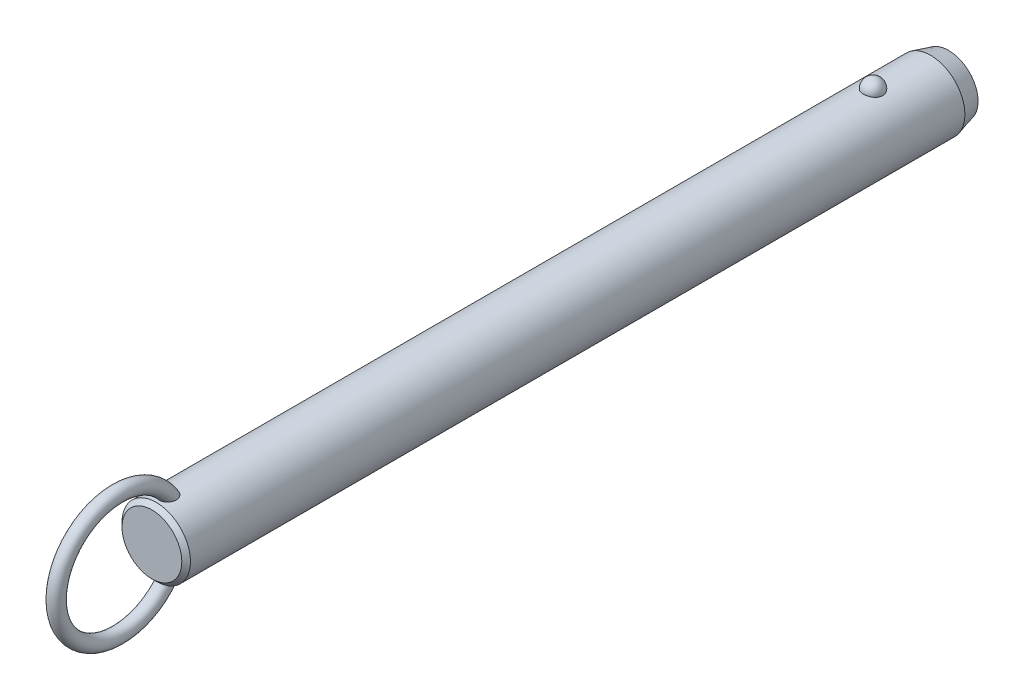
ISO-10303-21;
HEADER;
FILE_DESCRIPTION(('STEP AP214'),'2;1');
FILE_NAME('part.step','',(''),(''),'','','');
FILE_SCHEMA(('AUTOMOTIVE_DESIGN { 1 0 10303 214 1 1 1 1 }'));
ENDSEC;
DATA;
#1=APPLICATION_CONTEXT('core data for automotive mechanical design processes');
#2=APPLICATION_PROTOCOL_DEFINITION('international standard','automotive_design',2000,#1);
#3=PRODUCT_CONTEXT('',#1,'mechanical');
#4=PRODUCT('Part','Part','',(#3));
#5=PRODUCT_RELATED_PRODUCT_CATEGORY('part','',(#4));
#6=PRODUCT_DEFINITION_FORMATION('','',#4);
#7=PRODUCT_DEFINITION_CONTEXT('part definition',#1,'design');
#8=PRODUCT_DEFINITION('design','',#6,#7);
#9=PRODUCT_DEFINITION_SHAPE('','',#8);
#10=(LENGTH_UNIT() NAMED_UNIT(*) SI_UNIT(.MILLI.,.METRE.));
#11=(NAMED_UNIT(*) PLANE_ANGLE_UNIT() SI_UNIT($,.RADIAN.));
#12=(NAMED_UNIT(*) SI_UNIT($,.STERADIAN.) SOLID_ANGLE_UNIT());
#13=UNCERTAINTY_MEASURE_WITH_UNIT(LENGTH_MEASURE(1.E-05),#10,'distance_accuracy_value','');
#14=(GEOMETRIC_REPRESENTATION_CONTEXT(3) GLOBAL_UNCERTAINTY_ASSIGNED_CONTEXT((#13)) GLOBAL_UNIT_ASSIGNED_CONTEXT((#10,
#11,#12)) REPRESENTATION_CONTEXT('',''));
#15=CARTESIAN_POINT('',(0.,0.,0.));
#16=DIRECTION('',(0.,0.,1.));
#17=DIRECTION('',(1.,0.,0.));
#18=AXIS2_PLACEMENT_3D('',#15,#16,#17);
#19=CARTESIAN_POINT('',(0.,0.,188.));
#20=DIRECTION('',(0.,0.,-1.));
#21=DIRECTION('',(-1.,0.,0.));
#22=AXIS2_PLACEMENT_3D('',#19,#20,#21);
#23=CYLINDRICAL_SURFACE('',#22,9.5);
#24=CARTESIAN_POINT('',(2.67259918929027,9.11631578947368,-2.70000000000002));
#25=CARTESIAN_POINT('',(2.6725968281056,9.11631786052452,-2.54909854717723));
#26=CARTESIAN_POINT('',(2.66030567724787,9.11994722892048,-2.39816735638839));
#27=CARTESIAN_POINT('',(2.6114347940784,9.13405924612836,-2.10058568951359));
#28=CARTESIAN_POINT('',(2.57484658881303,9.14454428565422,-1.95393672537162));
#29=CARTESIAN_POINT('',(2.47830875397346,9.17117631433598,-1.66916069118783));
#30=CARTESIAN_POINT('',(2.41836936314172,9.18732082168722,-1.53102991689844));
#31=CARTESIAN_POINT('',(2.27661331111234,9.22346780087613,-1.26705393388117));
#32=CARTESIAN_POINT('',(2.19479699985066,9.24347021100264,-1.14120852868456));
#33=CARTESIAN_POINT('',(2.01085282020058,9.28522401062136,-0.904632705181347));
#34=CARTESIAN_POINT('',(1.90862396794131,9.30698376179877,-0.793982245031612));
#35=CARTESIAN_POINT('',(1.6867437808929,9.34973971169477,-0.591607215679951));
#36=CARTESIAN_POINT('',(1.56709244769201,9.37073591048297,-0.499882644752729));
#37=CARTESIAN_POINT('',(1.31393976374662,9.40956370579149,-0.33816762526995));
#38=CARTESIAN_POINT('',(1.18048026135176,9.42740444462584,-0.268113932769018));
#39=CARTESIAN_POINT('',(0.903154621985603,9.45799906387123,-0.151390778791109));
#40=CARTESIAN_POINT('',(0.759289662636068,9.47075351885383,-0.104718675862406));
#41=CARTESIAN_POINT('',(0.468074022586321,9.48956256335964,-0.0367633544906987));
#42=CARTESIAN_POINT('',(0.320836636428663,9.49573643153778,-0.015027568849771));
#43=CARTESIAN_POINT('',(0.0246714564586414,9.50112183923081,0.0039619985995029));
#44=CARTESIAN_POINT('',(-0.124256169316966,9.50033406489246,0.00121819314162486));
#45=CARTESIAN_POINT('',(-0.417264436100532,9.4919475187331,-0.0284441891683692));
#46=CARTESIAN_POINT('',(-0.56138413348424,9.48444885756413,-0.0550074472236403));
#47=CARTESIAN_POINT('',(-0.842986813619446,9.46357853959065,-0.131064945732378));
#48=CARTESIAN_POINT('',(-0.980469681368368,9.450206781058,-0.180559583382));
#49=CARTESIAN_POINT('',(-1.24585005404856,9.41890822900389,-0.301476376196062));
#50=CARTESIAN_POINT('',(-1.37368611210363,9.40095498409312,-0.373026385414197));
#51=CARTESIAN_POINT('',(-1.61552738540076,9.3624296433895,-0.53602540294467));
#52=CARTESIAN_POINT('',(-1.72953116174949,9.34185727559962,-0.62747647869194));
#53=CARTESIAN_POINT('',(-1.9429225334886,9.29984568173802,-0.829844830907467));
#54=CARTESIAN_POINT('',(-2.04198021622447,9.27839736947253,-0.941108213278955));
#55=CARTESIAN_POINT('',(-2.2202646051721,9.23735994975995,-1.17883414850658));
#56=CARTESIAN_POINT('',(-2.29948985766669,9.21777097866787,-1.30529781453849));
#57=CARTESIAN_POINT('',(-2.43697287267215,9.18238994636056,-1.57158566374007));
#58=CARTESIAN_POINT('',(-2.49497068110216,9.16664569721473,-1.71155057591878));
#59=CARTESIAN_POINT('',(-2.5872073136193,9.14104303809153,-1.99961197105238));
#60=CARTESIAN_POINT('',(-2.62144683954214,9.13118445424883,-2.1477082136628));
#61=CARTESIAN_POINT('',(-2.66521466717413,9.11850622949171,-2.44715424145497));
#62=CARTESIAN_POINT('',(-2.67484831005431,9.11565658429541,-2.59848735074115));
#63=CARTESIAN_POINT('',(-2.66946735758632,9.11723375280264,-2.90067317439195));
#64=CARTESIAN_POINT('',(-2.65445345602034,9.12166036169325,-3.05152590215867));
#65=CARTESIAN_POINT('',(-2.6002971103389,9.13724422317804,-3.34766110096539));
#66=CARTESIAN_POINT('',(-2.56127978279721,9.14836656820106,-3.49296833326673));
#67=CARTESIAN_POINT('',(-2.46018844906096,9.17606676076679,-3.77477535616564));
#68=CARTESIAN_POINT('',(-2.39811349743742,9.19264483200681,-3.91127478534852));
#69=CARTESIAN_POINT('',(-2.25202303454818,9.22952198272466,-4.17244273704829));
#70=CARTESIAN_POINT('',(-2.16788714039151,9.24984129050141,-4.29704106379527));
#71=CARTESIAN_POINT('',(-1.9799408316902,9.29188255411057,-4.53013066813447));
#72=CARTESIAN_POINT('',(-1.87612963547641,9.31360456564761,-4.63862130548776));
#73=CARTESIAN_POINT('',(-1.65105429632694,9.35612959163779,-4.83690299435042));
#74=CARTESIAN_POINT('',(-1.52972405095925,9.37692871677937,-4.9266199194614));
#75=CARTESIAN_POINT('',(-1.27318250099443,9.41518970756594,-5.08429106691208));
#76=CARTESIAN_POINT('',(-1.13797219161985,9.432651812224,-5.15224684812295));
#77=CARTESIAN_POINT('',(-0.859280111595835,9.46208255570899,-5.26371827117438));
#78=CARTESIAN_POINT('',(-0.715925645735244,9.47411833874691,-5.30753421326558));
#79=CARTESIAN_POINT('',(-0.423550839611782,9.4916822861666,-5.37076321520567));
#80=CARTESIAN_POINT('',(-0.2745312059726,9.49721125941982,-5.39017930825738));
#81=CARTESIAN_POINT('',(0.0218446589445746,9.50110860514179,-5.40390587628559));
#82=CARTESIAN_POINT('',(0.16917707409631,9.49961381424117,-5.39869609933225));
#83=CARTESIAN_POINT('',(0.460808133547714,9.48993906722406,-5.36441955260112));
#84=CARTESIAN_POINT('',(0.605106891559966,9.48175936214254,-5.33535367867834));
#85=CARTESIAN_POINT('',(0.886027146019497,9.4596376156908,-5.25435587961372));
#86=CARTESIAN_POINT('',(1.02267710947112,9.44571881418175,-5.20251612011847));
#87=CARTESIAN_POINT('',(1.28523827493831,9.41358993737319,-5.07741549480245));
#88=CARTESIAN_POINT('',(1.41114877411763,9.39537958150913,-5.00415322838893));
#89=CARTESIAN_POINT('',(1.65085227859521,9.3562644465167,-4.83684599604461));
#90=CARTESIAN_POINT('',(1.76442346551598,9.33532178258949,-4.74249218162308));
#91=CARTESIAN_POINT('',(1.97425672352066,9.29321198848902,-4.53620389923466));
#92=CARTESIAN_POINT('',(2.07051582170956,9.27204482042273,-4.42426641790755));
#93=CARTESIAN_POINT('',(2.24490086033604,9.23139221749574,-4.18363183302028));
#94=CARTESIAN_POINT('',(2.32267019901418,9.21194380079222,-4.05466990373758));
#95=CARTESIAN_POINT('',(2.45584092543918,9.1773419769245,-3.78517836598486));
#96=CARTESIAN_POINT('',(2.51124979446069,9.16218713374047,-3.644652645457));
#97=CARTESIAN_POINT('',(2.59380876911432,9.13913522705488,-3.37104301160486));
#98=CARTESIAN_POINT('',(2.62330266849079,9.13064624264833,-3.23871053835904));
#99=CARTESIAN_POINT('',(2.66269870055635,9.11923566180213,-2.97092664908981));
#100=CARTESIAN_POINT('',(2.67260130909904,9.11631393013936,-2.83547530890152));
#101=CARTESIAN_POINT('',(2.67259918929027,9.11631578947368,-2.70000000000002));
#102=B_SPLINE_CURVE_WITH_KNOTS('',3,(#24,#25,#26,#27,#28,#29,#30,#31,#32,#33,#34,#35,#36,#37,
#38,#39,#40,#41,#42,#43,#44,#45,#46,#47,#48,#49,#50,#51,#52,#53,#54,#55,#56,#57,#58,#59,#60,#61,
#62,#63,#64,#65,#66,#67,#68,#69,#70,#71,#72,#73,#74,#75,#76,#77,#78,#79,#80,#81,#82,#83,#84,#85,
#86,#87,#88,#89,#90,#91,#92,#93,#94,#95,#96,#97,#98,#99,#100,#101),.UNSPECIFIED.,.T.,.F.,(4,2,2,
2,2,2,2,2,2,2,2,2,2,2,2,2,2,2,2,2,2,2,2,2,2,2,2,2,2,2,2,2,2,2,2,2,2,2,4),(0.,0.452217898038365,
0.904593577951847,1.35677112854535,1.80894144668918,2.26340676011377,2.71787203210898,
3.17099820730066,3.62407318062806,4.0687883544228,4.51345969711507,4.95160616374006,
5.38976021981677,5.83050358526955,6.27129275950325,6.72071308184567,7.17016633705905,
7.62495278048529,8.07972578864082,8.53254856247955,8.98535859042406,9.43582813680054,
9.88631615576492,10.3393155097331,10.7923328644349,11.2471065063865,11.7018475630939,
12.150795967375,12.5996885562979,13.0398725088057,13.4800399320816,13.9184421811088,
14.3568730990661,14.802202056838,15.2476074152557,15.7010097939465,16.1542603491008,
16.5602594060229,16.9662486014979),.UNSPECIFIED.);
#103=CARTESIAN_POINT('',(2.67259918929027,9.11631578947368,-2.70000000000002));
#104=VERTEX_POINT('',#103);
#105=EDGE_CURVE('E41',#104,#104,#102,.T.);
#106=ORIENTED_EDGE('',*,*,#105,.T.);
#107=EDGE_LOOP('',(#106));
#108=FACE_BOUND('',#107,.T.);
#109=CARTESIAN_POINT('',(0.,0.,196.32));
#110=DIRECTION('',(0.,0.,1.));
#111=DIRECTION('',(1.,0.,0.));
#112=AXIS2_PLACEMENT_3D('',#109,#110,#111);
#113=CIRCLE('',#112,9.5);
#114=CARTESIAN_POINT('',(9.5,0.,196.32));
#115=VERTEX_POINT('',#114);
#116=EDGE_CURVE('E10',#115,#115,#113,.F.);
#117=ORIENTED_EDGE('',*,*,#116,.T.);
#118=EDGE_LOOP('',(#117));
#119=FACE_BOUND('',#118,.T.);
#120=CARTESIAN_POINT('',(-0.697062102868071,-9.47439269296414,190.667808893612));
#121=CARTESIAN_POINT('',(-0.799579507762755,-9.46685146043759,190.707482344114));
#122=CARTESIAN_POINT('',(-0.898575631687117,-9.45788043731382,190.7559309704));
#123=CARTESIAN_POINT('',(-1.08670047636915,-9.43811593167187,190.868868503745));
#124=CARTESIAN_POINT('',(-1.17583204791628,-9.42732297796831,190.933352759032));
#125=CARTESIAN_POINT('',(-1.34179806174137,-9.40513672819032,191.076209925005));
#126=CARTESIAN_POINT('',(-1.41865133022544,-9.39374438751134,191.154561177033));
#127=CARTESIAN_POINT('',(-1.55860047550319,-9.37154196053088,191.322752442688));
#128=CARTESIAN_POINT('',(-1.62169476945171,-9.3607319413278,191.41259377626));
#129=CARTESIAN_POINT('',(-1.73527695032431,-9.34035749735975,191.604500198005));
#130=CARTESIAN_POINT('',(-1.78522266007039,-9.33085270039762,191.706891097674));
#131=CARTESIAN_POINT('',(-1.86924997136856,-9.3143834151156,191.918148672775));
#132=CARTESIAN_POINT('',(-1.90332570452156,-9.30741986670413,192.027017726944));
#133=CARTESIAN_POINT('',(-1.95893603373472,-9.29588482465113,192.260473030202));
#134=CARTESIAN_POINT('',(-1.97872420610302,-9.29165182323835,192.385489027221));
#135=CARTESIAN_POINT('',(-2.00062129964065,-9.28695978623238,192.637080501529));
#136=CARTESIAN_POINT('',(-2.00272284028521,-9.28650232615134,192.763656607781));
#137=CARTESIAN_POINT('',(-1.98958876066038,-9.28932750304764,193.036815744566));
#138=CARTESIAN_POINT('',(-1.97143366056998,-9.2932400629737,193.183251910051));
#139=CARTESIAN_POINT('',(-1.91479925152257,-9.30507151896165,193.472062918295));
#140=CARTESIAN_POINT('',(-1.87629122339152,-9.31299607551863,193.614431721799));
#141=CARTESIAN_POINT('',(-1.77225683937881,-9.33340232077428,193.915172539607));
#142=CARTESIAN_POINT('',(-1.70334898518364,-9.34641636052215,194.072369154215));
#143=CARTESIAN_POINT('',(-1.58111062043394,-9.36759153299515,194.297517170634));
#144=CARTESIAN_POINT('',(-1.53721459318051,-9.37492619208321,194.370796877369));
#145=CARTESIAN_POINT('',(-1.4430263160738,-9.38988566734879,194.51307405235));
#146=CARTESIAN_POINT('',(-1.39273721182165,-9.39751033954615,194.582073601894));
#147=CARTESIAN_POINT('',(-1.26775962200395,-9.41530678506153,194.736983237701));
#148=CARTESIAN_POINT('',(-1.19052326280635,-9.42548108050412,194.820871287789));
#149=CARTESIAN_POINT('',(-1.02420241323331,-9.44499825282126,194.976008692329));
#150=CARTESIAN_POINT('',(-0.93513986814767,-9.45434261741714,195.047280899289));
#151=CARTESIAN_POINT('',(-0.766610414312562,-9.46930670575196,195.158695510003));
#152=CARTESIAN_POINT('',(-0.689439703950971,-9.47529223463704,195.202235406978));
#153=CARTESIAN_POINT('',(-0.528942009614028,-9.48560294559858,195.27631336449));
#154=CARTESIAN_POINT('',(-0.445620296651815,-9.48992953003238,195.306862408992));
#155=CARTESIAN_POINT('',(-0.273901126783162,-9.49644161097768,195.352579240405));
#156=CARTESIAN_POINT('',(-0.18546574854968,-9.49860811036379,195.36761059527));
#157=CARTESIAN_POINT('',(-0.00734541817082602,-9.5004135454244,195.380149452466));
#158=CARTESIAN_POINT('',(0.0823387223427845,-9.50005405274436,195.377667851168));
#159=CARTESIAN_POINT('',(0.24767927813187,-9.49708301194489,195.356995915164));
#160=CARTESIAN_POINT('',(0.323620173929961,-9.49477609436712,195.340930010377));
#161=CARTESIAN_POINT('',(0.471981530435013,-9.48855917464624,195.297172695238));
#162=CARTESIAN_POINT('',(0.544400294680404,-9.48464840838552,195.269475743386));
#163=CARTESIAN_POINT('',(0.708947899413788,-9.47398336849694,195.19280266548));
#164=CARTESIAN_POINT('',(0.799149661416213,-9.46671310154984,195.139774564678));
#165=CARTESIAN_POINT('',(0.969783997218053,-9.45076225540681,195.019973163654));
#166=CARTESIAN_POINT('',(1.050194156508,-9.44207854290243,194.953169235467));
#167=CARTESIAN_POINT('',(1.23092343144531,-9.42051459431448,194.780759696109));
#168=CARTESIAN_POINT('',(1.32652499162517,-9.40733378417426,194.67026193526));
#169=CARTESIAN_POINT('',(1.49893121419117,-9.38140745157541,194.435561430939));
#170=CARTESIAN_POINT('',(1.57571616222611,-9.36866239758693,194.311344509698));
#171=CARTESIAN_POINT('',(1.71285426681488,-9.34457644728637,194.049389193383));
#172=CARTESIAN_POINT('',(1.77266365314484,-9.33328726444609,193.91136233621));
#173=CARTESIAN_POINT('',(1.87239208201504,-9.31379209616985,193.628051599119));
#174=CARTESIAN_POINT('',(1.91230158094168,-9.3055875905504,193.482764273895));
#175=CARTESIAN_POINT('',(1.97604189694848,-9.29228394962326,193.162028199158));
#176=CARTESIAN_POINT('',(1.9958743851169,-9.28797202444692,192.985724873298));
#177=CARTESIAN_POINT('',(2.0029570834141,-9.28645519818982,192.632414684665));
#178=CARTESIAN_POINT('',(1.99025930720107,-9.28923895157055,192.455409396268));
#179=CARTESIAN_POINT('',(1.93735479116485,-9.30038134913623,192.156338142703));
#180=CARTESIAN_POINT('',(1.90576827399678,-9.30697680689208,192.032667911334));
#181=CARTESIAN_POINT('',(1.8228748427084,-9.32356855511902,191.792329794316));
#182=CARTESIAN_POINT('',(1.77158213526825,-9.33356239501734,191.675656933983));
#183=CARTESIAN_POINT('',(1.64885744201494,-9.35602275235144,191.452706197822));
#184=CARTESIAN_POINT('',(1.57730995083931,-9.36850332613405,191.346492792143));
#185=CARTESIAN_POINT('',(1.41543264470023,-9.39431873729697,191.149553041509));
#186=CARTESIAN_POINT('',(1.32510883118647,-9.40765330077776,191.058821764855));
#187=CARTESIAN_POINT('',(1.13846223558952,-9.43195720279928,190.905033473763));
#188=CARTESIAN_POINT('',(1.04369890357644,-9.44302894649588,190.840094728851));
#189=CARTESIAN_POINT('',(0.843965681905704,-9.46296805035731,190.728038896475));
#190=CARTESIAN_POINT('',(0.739000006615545,-9.47183631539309,190.680914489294));
#191=CARTESIAN_POINT('',(0.528175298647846,-9.48586140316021,190.608117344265));
#192=CARTESIAN_POINT('',(0.422686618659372,-9.49119633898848,190.58140249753));
#193=CARTESIAN_POINT('',(0.208590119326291,-9.49831365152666,190.546013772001));
#194=CARTESIAN_POINT('',(0.0999817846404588,-9.500095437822,190.537342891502));
#195=CARTESIAN_POINT('',(-0.126104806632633,-9.49988861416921,190.538350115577));
#196=CARTESIAN_POINT('',(-0.243578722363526,-9.49757821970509,190.549594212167));
#197=CARTESIAN_POINT('',(-0.474390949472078,-9.48885165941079,190.593167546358));
#198=CARTESIAN_POINT('',(-0.587729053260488,-9.48243528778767,190.625497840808));
#199=CARTESIAN_POINT('',(-0.697062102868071,-9.47439269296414,190.667808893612));
#200=B_SPLINE_CURVE_WITH_KNOTS('',3,(#120,#121,#122,#123,#124,#125,#126,#127,#128,#129,#130,
#131,#132,#133,#134,#135,#136,#137,#138,#139,#140,#141,#142,#143,#144,#145,#146,#147,#148,#149,
#150,#151,#152,#153,#154,#155,#156,#157,#158,#159,#160,#161,#162,#163,#164,#165,#166,#167,#168,
#169,#170,#171,#172,#173,#174,#175,#176,#177,#178,#179,#180,#181,#182,#183,#184,#185,#186,#187,
#188,#189,#190,#191,#192,#193,#194,#195,#196,#197,#198,#199),.UNSPECIFIED.,.T.,.F.,(4,2,2,2,2,2,
2,2,2,2,2,2,2,2,2,2,2,2,2,2,2,2,2,2,2,2,2,2,2,2,2,2,2,2,2,2,2,2,2,4),(0.,0.330119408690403,
0.660143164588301,0.989655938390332,1.31920659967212,1.66074728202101,2.00241415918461,
2.38088696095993,2.75951768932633,3.20065679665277,3.64242004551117,4.15620996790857,
4.4131416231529,4.66994734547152,5.01228664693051,5.35399933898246,5.61943037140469,
5.88463652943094,6.15215502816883,6.4195070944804,6.65144391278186,6.88349136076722,
7.19641200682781,7.51003602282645,7.94779711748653,8.3860149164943,8.83699707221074,
9.28819530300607,9.81778662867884,10.34653170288,10.7284172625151,11.1100280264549,
11.4938603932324,11.8775702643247,12.2220189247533,12.5663259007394,12.8915939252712,
13.2169159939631,13.5689650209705,13.9210316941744),.UNSPECIFIED.);
#201=CARTESIAN_POINT('',(-0.697062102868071,-9.47439269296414,190.667808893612));
#202=VERTEX_POINT('',#201);
#203=EDGE_CURVE('E60',#202,#202,#200,.T.);
#204=ORIENTED_EDGE('',*,*,#203,.T.);
#205=EDGE_LOOP('',(#204));
#206=FACE_BOUND('',#205,.T.);
#207=CARTESIAN_POINT('',(-0.697062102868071,9.47439269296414,190.667808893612));
#208=CARTESIAN_POINT('',(-0.597792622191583,9.48169483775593,190.62939564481));
#209=CARTESIAN_POINT('',(-0.495106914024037,9.48766580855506,190.599168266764));
#210=CARTESIAN_POINT('',(-0.285876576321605,9.49627648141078,190.556032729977));
#211=CARTESIAN_POINT('',(-0.179324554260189,9.49890941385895,190.543159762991));
#212=CARTESIAN_POINT('',(0.0344157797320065,9.50053798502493,190.535166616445));
#213=CARTESIAN_POINT('',(0.141603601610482,9.49953613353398,190.540034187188));
#214=CARTESIAN_POINT('',(0.35356357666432,9.49401038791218,190.567365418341));
#215=CARTESIAN_POINT('',(0.458336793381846,9.48948807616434,190.58982117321));
#216=CARTESIAN_POINT('',(0.662493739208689,9.4774236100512,190.651671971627));
#217=CARTESIAN_POINT('',(0.761881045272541,9.46988348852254,190.691055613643));
#218=CARTESIAN_POINT('',(0.95260839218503,9.45260382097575,190.785634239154));
#219=CARTESIAN_POINT('',(1.04394806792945,9.44286417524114,190.840829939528));
#220=CARTESIAN_POINT('',(1.21712767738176,9.42211760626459,190.966066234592));
#221=CARTESIAN_POINT('',(1.29885671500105,9.41109835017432,191.036257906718));
#222=CARTESIAN_POINT('',(1.44978975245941,9.38903310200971,191.188980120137));
#223=CARTESIAN_POINT('',(1.51899278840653,9.37798710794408,191.271511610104));
#224=CARTESIAN_POINT('',(1.64602857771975,9.35654375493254,191.449776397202));
#225=CARTESIAN_POINT('',(1.70333052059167,9.34618688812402,191.545891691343));
#226=CARTESIAN_POINT('',(1.80259341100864,9.32755128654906,191.745897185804));
#227=CARTESIAN_POINT('',(1.84454942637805,9.31927322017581,191.849789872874));
#228=CARTESIAN_POINT('',(1.91637039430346,9.30478365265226,192.072213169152));
#229=CARTESIAN_POINT('',(1.944805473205,9.29882552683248,192.191219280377));
#230=CARTESIAN_POINT('',(1.98449865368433,9.29043398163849,192.432143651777));
#231=CARTESIAN_POINT('',(1.99574908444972,9.28800213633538,192.554063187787));
#232=CARTESIAN_POINT('',(2.00275141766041,9.28649645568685,192.816932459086));
#233=CARTESIAN_POINT('',(1.99588238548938,9.28799035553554,192.957952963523));
#234=CARTESIAN_POINT('',(1.96270559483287,9.29505517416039,193.237621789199));
#235=CARTESIAN_POINT('',(1.93637872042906,9.30063010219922,193.376267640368));
#236=CARTESIAN_POINT('',(1.85949176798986,9.31633564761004,193.672561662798));
#237=CARTESIAN_POINT('',(1.80549792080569,9.3270926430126,193.829290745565));
#238=CARTESIAN_POINT('',(1.67376869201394,9.3516306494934,194.132284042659));
#239=CARTESIAN_POINT('',(1.59603181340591,9.36541185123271,194.278547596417));
#240=CARTESIAN_POINT('',(1.4360277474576,9.39110706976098,194.525813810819));
#241=CARTESIAN_POINT('',(1.35831795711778,9.40278656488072,194.629791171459));
#242=CARTESIAN_POINT('',(1.18774483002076,9.42585025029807,194.824534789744));
#243=CARTESIAN_POINT('',(1.09490932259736,9.43723493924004,194.915324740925));
#244=CARTESIAN_POINT('',(0.921110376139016,9.45552616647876,195.05620334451));
#245=CARTESIAN_POINT('',(0.843738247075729,9.46281058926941,195.110656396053));
#246=CARTESIAN_POINT('',(0.681245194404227,9.47589120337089,195.206711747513));
#247=CARTESIAN_POINT('',(0.596135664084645,9.48168953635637,195.248332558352));
#248=CARTESIAN_POINT('',(0.433779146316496,9.49038144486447,195.310089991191));
#249=CARTESIAN_POINT('',(0.357459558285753,9.49359170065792,195.33260136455));
#250=CARTESIAN_POINT('',(0.202074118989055,9.49816761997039,195.364574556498));
#251=CARTESIAN_POINT('',(0.123010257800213,9.49953459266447,195.374045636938));
#252=CARTESIAN_POINT('',(-0.03573724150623,9.50026497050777,195.379114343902));
#253=CARTESIAN_POINT('',(-0.115421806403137,9.49962433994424,195.374684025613));
#254=CARTESIAN_POINT('',(-0.272823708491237,9.49640854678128,195.352296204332));
#255=CARTESIAN_POINT('',(-0.350540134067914,9.4938325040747,195.334332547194));
#256=CARTESIAN_POINT('',(-0.500580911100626,9.48709462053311,195.286802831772));
#257=CARTESIAN_POINT('',(-0.572979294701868,9.48296359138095,195.257461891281));
#258=CARTESIAN_POINT('',(-0.712864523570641,9.47347609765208,195.189008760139));
#259=CARTESIAN_POINT('',(-0.780349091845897,9.46811906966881,195.149892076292));
#260=CARTESIAN_POINT('',(-0.946309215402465,9.45329720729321,195.039432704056));
#261=CARTESIAN_POINT('',(-1.04090230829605,9.44321512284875,194.962329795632));
#262=CARTESIAN_POINT('',(-1.21661929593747,9.42219227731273,194.79409718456));
#263=CARTESIAN_POINT('',(-1.29770519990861,9.41124921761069,194.702929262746));
#264=CARTESIAN_POINT('',(-1.47319646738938,9.38563439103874,194.476162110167));
#265=CARTESIAN_POINT('',(-1.56208878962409,9.37102009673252,194.336289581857));
#266=CARTESIAN_POINT('',(-1.71623987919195,9.34401559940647,194.043950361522));
#267=CARTESIAN_POINT('',(-1.78147866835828,9.33162728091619,193.891473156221));
#268=CARTESIAN_POINT('',(-1.88853837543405,9.31055541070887,193.575647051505));
#269=CARTESIAN_POINT('',(-1.92998995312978,9.30193076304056,193.412168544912));
#270=CARTESIAN_POINT('',(-1.98590726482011,9.29015757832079,193.080526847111));
#271=CARTESIAN_POINT('',(-2.0004070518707,9.2870021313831,192.912369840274));
#272=CARTESIAN_POINT('',(-1.99964701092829,9.28716218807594,192.605080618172));
#273=CARTESIAN_POINT('',(-1.98908145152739,9.28945704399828,192.465936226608));
#274=CARTESIAN_POINT('',(-1.94566294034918,9.29865169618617,192.191153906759));
#275=CARTESIAN_POINT('',(-1.9128206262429,9.30554929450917,192.055514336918));
#276=CARTESIAN_POINT('',(-1.84582133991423,9.31898248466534,191.857802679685));
#277=CARTESIAN_POINT('',(-1.82038084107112,9.32400364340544,191.792583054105));
#278=CARTESIAN_POINT('',(-1.76350511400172,9.33492884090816,191.664903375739));
#279=CARTESIAN_POINT('',(-1.73207305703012,9.34083241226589,191.602441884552));
#280=CARTESIAN_POINT('',(-1.66324243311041,9.35333332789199,191.48094078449));
#281=CARTESIAN_POINT('',(-1.62584239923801,9.35993084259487,191.421902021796));
#282=CARTESIAN_POINT('',(-1.54527678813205,9.37356864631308,191.307987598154));
#283=CARTESIAN_POINT('',(-1.50211241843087,9.38060884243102,191.253111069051));
#284=CARTESIAN_POINT('',(-1.3768114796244,9.40004442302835,191.109961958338));
#285=CARTESIAN_POINT('',(-1.28916358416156,9.41261047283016,191.026429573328));
#286=CARTESIAN_POINT('',(-1.09996826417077,9.43658180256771,190.877236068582));
#287=CARTESIAN_POINT('',(-0.998461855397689,9.44799034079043,190.811523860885));
#288=CARTESIAN_POINT('',(-0.860188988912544,9.46103017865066,190.7394367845));
#289=CARTESIAN_POINT('',(-0.828141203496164,9.46389141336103,190.723851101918));
#290=CARTESIAN_POINT('',(-0.763210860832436,9.46934915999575,190.694473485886));
#291=CARTESIAN_POINT('',(-0.730328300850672,9.47194567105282,190.680681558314));
#292=CARTESIAN_POINT('',(-0.697062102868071,9.47439269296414,190.667808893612));
#293=B_SPLINE_CURVE_WITH_KNOTS('',3,(#207,#208,#209,#210,#211,#212,#213,#214,#215,#216,#217,
#218,#219,#220,#221,#222,#223,#224,#225,#226,#227,#228,#229,#230,#231,#232,#233,#234,#235,#236,
#237,#238,#239,#240,#241,#242,#243,#244,#245,#246,#247,#248,#249,#250,#251,#252,#253,#254,#255,
#256,#257,#258,#259,#260,#261,#262,#263,#264,#265,#266,#267,#268,#269,#270,#271,#272,#273,#274,
#275,#276,#277,#278,#279,#280,#281,#282,#283,#284,#285,#286,#287,#288,#289,#290,#291,#292),
.UNSPECIFIED.,.T.,.F.,(4,2,2,2,2,2,2,2,2,2,2,2,2,2,2,2,2,2,2,2,2,2,2,2,2,2,2,2,2,2,2,2,2,2,2,2,
2,2,2,2,2,2,4),(0.,0.319942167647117,0.640532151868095,0.96090081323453,1.2811255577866,
1.60113495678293,1.92115886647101,2.24457323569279,2.56801248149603,2.90371927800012,
3.23953387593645,3.60560313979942,3.97183576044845,4.39383693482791,4.8162532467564,
5.31257045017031,5.80891895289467,6.19868344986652,6.58773876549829,6.87145417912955,
7.15475838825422,7.39263751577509,7.63034760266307,7.86853584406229,8.10683246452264,
8.3406366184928,8.57454843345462,8.93983939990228,9.30614105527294,9.80266668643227,
10.2996107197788,10.8040753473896,11.3079021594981,11.7249776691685,12.1418541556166,
12.3521485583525,12.5623319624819,12.7725671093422,12.9827582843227,13.345827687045,
13.7078449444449,13.8150604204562,13.9222762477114),.UNSPECIFIED.);
#294=CARTESIAN_POINT('',(-0.697062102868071,9.47439269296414,190.667808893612));
#295=VERTEX_POINT('',#294);
#296=EDGE_CURVE('E68',#295,#295,#293,.T.);
#297=ORIENTED_EDGE('',*,*,#296,.T.);
#298=EDGE_LOOP('',(#297));
#299=FACE_BOUND('',#298,.T.);
#300=CARTESIAN_POINT('',(0.,0.,-18.6999999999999));
#301=DIRECTION('',(0.,0.,-1.));
#302=DIRECTION('',(-1.,0.,0.));
#303=AXIS2_PLACEMENT_3D('',#300,#301,#302);
#304=CIRCLE('',#303,9.5);
#305=CARTESIAN_POINT('',(-9.5,0.,-18.6999999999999));
#306=VERTEX_POINT('',#305);
#307=EDGE_CURVE('E57',#306,#306,#304,.F.);
#308=ORIENTED_EDGE('',*,*,#307,.T.);
#309=EDGE_LOOP('',(#308));
#310=FACE_BOUND('',#309,.T.);
#311=ADVANCED_FACE('F37',(#108,#119,#206,#299,#310),#23,.T.);
#312=CARTESIAN_POINT('',(0.,0.,-23.7));
#313=DIRECTION('',(0.,0.,-1.));
#314=DIRECTION('',(-1.,0.,0.));
#315=AXIS2_PLACEMENT_3D('',#312,#313,#314);
#316=PLANE('',#315);
#317=CARTESIAN_POINT('',(0.,0.,-23.7));
#318=DIRECTION('',(0.,0.,-1.));
#319=DIRECTION('',(-1.,0.,0.));
#320=AXIS2_PLACEMENT_3D('',#317,#318,#319);
#321=CIRCLE('',#320,8.16025403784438);
#322=CARTESIAN_POINT('',(-8.16025403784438,0.,-23.7));
#323=VERTEX_POINT('',#322);
#324=EDGE_CURVE('E67',#323,#323,#321,.T.);
#325=ORIENTED_EDGE('',*,*,#324,.T.);
#326=EDGE_LOOP('',(#325));
#327=FACE_BOUND('',#326,.T.);
#328=ADVANCED_FACE('F86',(#327),#316,.T.);
#329=CARTESIAN_POINT('',(0.,0.,-23.7));
#330=DIRECTION('',(0.,0.,1.));
#331=DIRECTION('',(1.,0.,0.));
#332=AXIS2_PLACEMENT_3D('',#329,#330,#331);
#333=CONICAL_SURFACE('',#332,8.16025403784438,0.261799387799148);
#334=ORIENTED_EDGE('',*,*,#307,.F.);
#335=EDGE_LOOP('',(#334));
#336=FACE_BOUND('',#335,.T.);
#337=ORIENTED_EDGE('',*,*,#324,.F.);
#338=EDGE_LOOP('',(#337));
#339=FACE_BOUND('',#338,.T.);
#340=ADVANCED_FACE('F84',(#336,#339),#333,.T.);
#341=CARTESIAN_POINT('',(0.,0.,197.52));
#342=DIRECTION('',(0.,0.,1.));
#343=DIRECTION('',(1.,0.,0.));
#344=AXIS2_PLACEMENT_3D('',#341,#342,#343);
#345=PLANE('',#344);
#346=CARTESIAN_POINT('',(0.,0.,197.52));
#347=DIRECTION('',(0.,0.,1.));
#348=DIRECTION('',(1.,0.,0.));
#349=AXIS2_PLACEMENT_3D('',#346,#347,#348);
#350=CIRCLE('',#349,8.29999999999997);
#351=CARTESIAN_POINT('',(8.29999999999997,0.,197.52));
#352=VERTEX_POINT('',#351);
#353=EDGE_CURVE('E50',#352,#352,#350,.T.);
#354=ORIENTED_EDGE('',*,*,#353,.T.);
#355=EDGE_LOOP('',(#354));
#356=FACE_BOUND('',#355,.T.);
#357=ADVANCED_FACE('F78',(#356),#345,.T.);
#358=CARTESIAN_POINT('',(0.,0.,207.05));
#359=DIRECTION('',(1.,0.,0.));
#360=DIRECTION('',(0.,0.,-1.));
#361=AXIS2_PLACEMENT_3D('',#358,#359,#360);
#362=TOROIDAL_SURFACE('',#361,17.05,2.);
#363=ORIENTED_EDGE('',*,*,#296,.F.);
#364=EDGE_LOOP('',(#363));
#365=FACE_BOUND('',#364,.T.);
#366=ORIENTED_EDGE('',*,*,#203,.F.);
#367=EDGE_LOOP('',(#366));
#368=FACE_BOUND('',#367,.T.);
#369=ADVANCED_FACE('F74',(#365,#368),#362,.T.);
#370=CARTESIAN_POINT('',(0.,0.,197.52));
#371=DIRECTION('',(0.,0.,-1.));
#372=DIRECTION('',(-1.,0.,0.));
#373=AXIS2_PLACEMENT_3D('',#370,#371,#372);
#374=CONICAL_SURFACE('',#373,8.29999999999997,0.785398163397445);
#375=ORIENTED_EDGE('',*,*,#116,.F.);
#376=EDGE_LOOP('',(#375));
#377=FACE_BOUND('',#376,.T.);
#378=ORIENTED_EDGE('',*,*,#353,.F.);
#379=EDGE_LOOP('',(#378));
#380=FACE_BOUND('',#379,.T.);
#381=ADVANCED_FACE('F39',(#377,#380),#374,.T.);
#382=CARTESIAN_POINT('',(0.,9.5,-2.70000000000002));
#383=DIRECTION('',(0.,1.,0.));
#384=DIRECTION('',(0.,0.,-1.));
#385=AXIS2_PLACEMENT_3D('',#382,#383,#384);
#386=SPHERICAL_SURFACE('',#385,2.7);
#387=ORIENTED_EDGE('',*,*,#105,.F.);
#388=EDGE_LOOP('',(#387));
#389=FACE_BOUND('',#388,.T.);
#390=ADVANCED_FACE('F80',(#389),#386,.T.);
#391=CLOSED_SHELL('',(#311,#328,#340,#357,#369,#381,#390));
#392=MANIFOLD_SOLID_BREP('B2',#391);
#393=ADVANCED_BREP_SHAPE_REPRESENTATION('',(#18,#392),#14);
#394=SHAPE_DEFINITION_REPRESENTATION(#9,#393);
ENDSEC;
END-ISO-10303-21;
